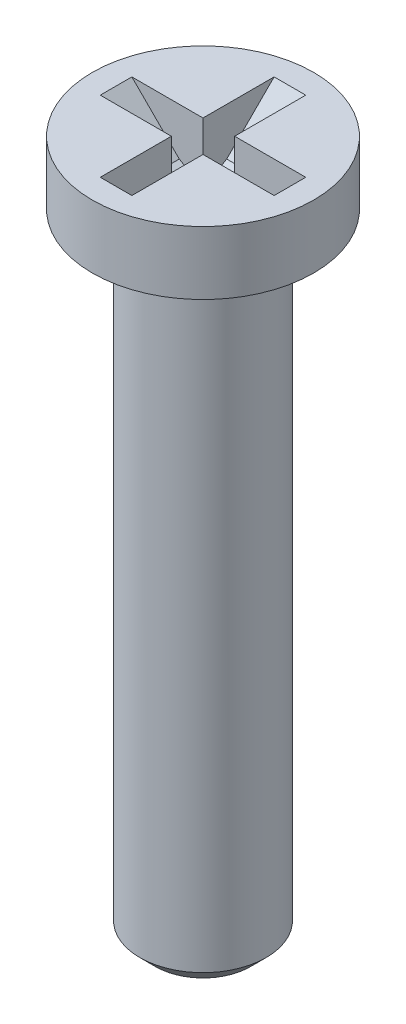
ISO-10303-21;
HEADER;
FILE_DESCRIPTION(('STEP AP214'),'2;1');
FILE_NAME('part.step','',(''),(''),'','','');
FILE_SCHEMA(('AUTOMOTIVE_DESIGN { 1 0 10303 214 1 1 1 1 }'));
ENDSEC;
DATA;
#1=APPLICATION_CONTEXT('core data for automotive mechanical design processes');
#2=APPLICATION_PROTOCOL_DEFINITION('international standard','automotive_design',2000,#1);
#3=PRODUCT_CONTEXT('',#1,'mechanical');
#4=PRODUCT('Part','Part','',(#3));
#5=PRODUCT_RELATED_PRODUCT_CATEGORY('part','',(#4));
#6=PRODUCT_DEFINITION_FORMATION('','',#4);
#7=PRODUCT_DEFINITION_CONTEXT('part definition',#1,'design');
#8=PRODUCT_DEFINITION('design','',#6,#7);
#9=PRODUCT_DEFINITION_SHAPE('','',#8);
#10=(LENGTH_UNIT() NAMED_UNIT(*) SI_UNIT(.MILLI.,.METRE.));
#11=(NAMED_UNIT(*) PLANE_ANGLE_UNIT() SI_UNIT($,.RADIAN.));
#12=(NAMED_UNIT(*) SI_UNIT($,.STERADIAN.) SOLID_ANGLE_UNIT());
#13=UNCERTAINTY_MEASURE_WITH_UNIT(LENGTH_MEASURE(1.E-05),#10,'distance_accuracy_value','');
#14=(GEOMETRIC_REPRESENTATION_CONTEXT(3) GLOBAL_UNCERTAINTY_ASSIGNED_CONTEXT((#13)) GLOBAL_UNIT_ASSIGNED_CONTEXT((#10,
#11,#12)) REPRESENTATION_CONTEXT('',''));
#15=CARTESIAN_POINT('',(0.,0.,0.));
#16=DIRECTION('',(0.,0.,1.));
#17=DIRECTION('',(1.,0.,0.));
#18=AXIS2_PLACEMENT_3D('',#15,#16,#17);
#19=CARTESIAN_POINT('',(-0.2,-0.5732050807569,-0.2));
#20=DIRECTION('',(0.,-1.,0.));
#21=DIRECTION('',(0.,0.,-1.));
#22=AXIS2_PLACEMENT_3D('',#19,#20,#21);
#23=PLANE('',#22);
#24=DIRECTION('',(1.,0.,0.));
#25=VECTOR('',#24,1.);
#26=CARTESIAN_POINT('',(0.2,-0.573205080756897,-0.199999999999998));
#27=LINE('',#26,#25);
#28=CARTESIAN_POINT('',(0.199999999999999,-0.573205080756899,-0.2));
#29=VERTEX_POINT('',#28);
#30=CARTESIAN_POINT('',(-0.2,-0.573205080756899,-0.199999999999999));
#31=VERTEX_POINT('',#30);
#32=EDGE_CURVE('E135',#29,#31,#27,.F.);
#33=ORIENTED_EDGE('',*,*,#32,.T.);
#34=DIRECTION('',(0.,0.,1.));
#35=VECTOR('',#34,1.);
#36=CARTESIAN_POINT('',(-0.199999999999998,-0.573205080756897,-0.2));
#37=LINE('',#36,#35);
#38=CARTESIAN_POINT('',(-0.2,-0.573205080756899,0.199999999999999));
#39=VERTEX_POINT('',#38);
#40=EDGE_CURVE('E116',#31,#39,#37,.T.);
#41=ORIENTED_EDGE('',*,*,#40,.T.);
#42=DIRECTION('',(1.,0.,0.));
#43=VECTOR('',#42,1.);
#44=CARTESIAN_POINT('',(-0.2,-0.573205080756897,0.199999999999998));
#45=LINE('',#44,#43);
#46=CARTESIAN_POINT('',(0.2,-0.573205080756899,0.199999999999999));
#47=VERTEX_POINT('',#46);
#48=EDGE_CURVE('E112',#39,#47,#45,.T.);
#49=ORIENTED_EDGE('',*,*,#48,.T.);
#50=DIRECTION('',(0.,0.,1.));
#51=VECTOR('',#50,1.);
#52=CARTESIAN_POINT('',(0.199999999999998,-0.573205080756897,0.2));
#53=LINE('',#52,#51);
#54=EDGE_CURVE('E137',#47,#29,#53,.F.);
#55=ORIENTED_EDGE('',*,*,#54,.T.);
#56=EDGE_LOOP('',(#33,#41,#49,#55));
#57=FACE_BOUND('',#56,.T.);
#58=ADVANCED_FACE('F17',(#57),#23,.F.);
#59=CARTESIAN_POINT('',(-0.2,-0.4,0.5));
#60=DIRECTION('',(0.,-0.866025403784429,0.500000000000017));
#61=DIRECTION('',(0.,-0.500000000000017,-0.866025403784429));
#62=AXIS2_PLACEMENT_3D('',#59,#60,#61);
#63=PLANE('',#62);
#64=DIRECTION('',(0.,-0.500000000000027,-0.866025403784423));
#65=VECTOR('',#64,1.);
#66=CARTESIAN_POINT('',(0.2,-0.4,0.5));
#67=LINE('',#66,#65);
#68=CARTESIAN_POINT('',(0.2,-0.4,0.500000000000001));
#69=VERTEX_POINT('',#68);
#70=EDGE_CURVE('E130',#69,#47,#67,.T.);
#71=ORIENTED_EDGE('',*,*,#70,.T.);
#72=ORIENTED_EDGE('',*,*,#48,.F.);
#73=DIRECTION('',(0.,-0.500000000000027,-0.866025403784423));
#74=VECTOR('',#73,1.);
#75=CARTESIAN_POINT('',(-0.2,-0.4,0.5));
#76=LINE('',#75,#74);
#77=CARTESIAN_POINT('',(-0.2,-0.399999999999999,0.500000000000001));
#78=VERTEX_POINT('',#77);
#79=EDGE_CURVE('E109',#78,#39,#76,.T.);
#80=ORIENTED_EDGE('',*,*,#79,.F.);
#81=DIRECTION('',(1.,0.,0.));
#82=VECTOR('',#81,1.);
#83=CARTESIAN_POINT('',(-0.2,-0.4,0.5));
#84=LINE('',#83,#82);
#85=EDGE_CURVE('E105',#78,#69,#84,.T.);
#86=ORIENTED_EDGE('',*,*,#85,.T.);
#87=EDGE_LOOP('',(#71,#72,#80,#86));
#88=FACE_BOUND('',#87,.T.);
#89=ADVANCED_FACE('F111',(#88),#63,.F.);
#90=CARTESIAN_POINT('',(0.5,-0.4,0.2));
#91=DIRECTION('',(0.500000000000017,-0.866025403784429,0.));
#92=DIRECTION('',(0.866025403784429,0.500000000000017,0.));
#93=AXIS2_PLACEMENT_3D('',#90,#91,#92);
#94=PLANE('',#93);
#95=DIRECTION('',(-0.866025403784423,-0.500000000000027,0.));
#96=VECTOR('',#95,1.);
#97=CARTESIAN_POINT('',(0.5,-0.4,-0.2));
#98=LINE('',#97,#96);
#99=CARTESIAN_POINT('',(0.500000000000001,-0.4,-0.2));
#100=VERTEX_POINT('',#99);
#101=EDGE_CURVE('E212',#100,#29,#98,.T.);
#102=ORIENTED_EDGE('',*,*,#101,.T.);
#103=ORIENTED_EDGE('',*,*,#54,.F.);
#104=DIRECTION('',(0.866025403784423,0.500000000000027,0.));
#105=VECTOR('',#104,1.);
#106=CARTESIAN_POINT('',(0.2,-0.5732050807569,0.2));
#107=LINE('',#106,#105);
#108=CARTESIAN_POINT('',(0.500000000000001,-0.4,0.2));
#109=VERTEX_POINT('',#108);
#110=EDGE_CURVE('E223',#47,#109,#107,.T.);
#111=ORIENTED_EDGE('',*,*,#110,.T.);
#112=DIRECTION('',(0.,0.,1.));
#113=VECTOR('',#112,1.);
#114=CARTESIAN_POINT('',(0.5,-0.4,0.2));
#115=LINE('',#114,#113);
#116=EDGE_CURVE('E218',#109,#100,#115,.F.);
#117=ORIENTED_EDGE('',*,*,#116,.T.);
#118=EDGE_LOOP('',(#102,#103,#111,#117));
#119=FACE_BOUND('',#118,.T.);
#120=ADVANCED_FACE('F236',(#119),#94,.F.);
#121=CARTESIAN_POINT('',(0.2,-0.4,-0.5));
#122=DIRECTION('',(0.,-0.866025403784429,-0.500000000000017));
#123=DIRECTION('',(0.,0.500000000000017,-0.866025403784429));
#124=AXIS2_PLACEMENT_3D('',#121,#122,#123);
#125=PLANE('',#124);
#126=DIRECTION('',(0.,-0.500000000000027,0.866025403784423));
#127=VECTOR('',#126,1.);
#128=CARTESIAN_POINT('',(-0.2,-0.4,-0.5));
#129=LINE('',#128,#127);
#130=CARTESIAN_POINT('',(-0.2,-0.4,-0.500000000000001));
#131=VERTEX_POINT('',#130);
#132=EDGE_CURVE('E195',#131,#31,#129,.T.);
#133=ORIENTED_EDGE('',*,*,#132,.T.);
#134=ORIENTED_EDGE('',*,*,#32,.F.);
#135=DIRECTION('',(0.,-0.500000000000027,0.866025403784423));
#136=VECTOR('',#135,1.);
#137=CARTESIAN_POINT('',(0.2,-0.4,-0.5));
#138=LINE('',#137,#136);
#139=CARTESIAN_POINT('',(0.2,-0.399999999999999,-0.500000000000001));
#140=VERTEX_POINT('',#139);
#141=EDGE_CURVE('E209',#140,#29,#138,.T.);
#142=ORIENTED_EDGE('',*,*,#141,.F.);
#143=DIRECTION('',(1.,0.,0.));
#144=VECTOR('',#143,1.);
#145=CARTESIAN_POINT('',(0.2,-0.4,-0.5));
#146=LINE('',#145,#144);
#147=EDGE_CURVE('E201',#140,#131,#146,.F.);
#148=ORIENTED_EDGE('',*,*,#147,.T.);
#149=EDGE_LOOP('',(#133,#134,#142,#148));
#150=FACE_BOUND('',#149,.T.);
#151=ADVANCED_FACE('F257',(#150),#125,.F.);
#152=CARTESIAN_POINT('',(-0.5,-0.4,-0.2));
#153=DIRECTION('',(-0.500000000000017,-0.866025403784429,0.));
#154=DIRECTION('',(0.866025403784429,-0.500000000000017,0.));
#155=AXIS2_PLACEMENT_3D('',#152,#153,#154);
#156=PLANE('',#155);
#157=DIRECTION('',(0.866025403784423,-0.500000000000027,0.));
#158=VECTOR('',#157,1.);
#159=CARTESIAN_POINT('',(-0.5,-0.4,-0.2));
#160=LINE('',#159,#158);
#161=CARTESIAN_POINT('',(-0.500000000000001,-0.399999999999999,-0.2));
#162=VERTEX_POINT('',#161);
#163=EDGE_CURVE('E192',#162,#31,#160,.T.);
#164=ORIENTED_EDGE('',*,*,#163,.F.);
#165=DIRECTION('',(0.,0.,1.));
#166=VECTOR('',#165,1.);
#167=CARTESIAN_POINT('',(-0.5,-0.4,-0.2));
#168=LINE('',#167,#166);
#169=CARTESIAN_POINT('',(-0.500000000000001,-0.4,0.2));
#170=VERTEX_POINT('',#169);
#171=EDGE_CURVE('E184',#162,#170,#168,.T.);
#172=ORIENTED_EDGE('',*,*,#171,.T.);
#173=DIRECTION('',(0.866025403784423,-0.500000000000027,0.));
#174=VECTOR('',#173,1.);
#175=CARTESIAN_POINT('',(-0.5,-0.4,0.2));
#176=LINE('',#175,#174);
#177=EDGE_CURVE('E178',#170,#39,#176,.T.);
#178=ORIENTED_EDGE('',*,*,#177,.T.);
#179=ORIENTED_EDGE('',*,*,#40,.F.);
#180=EDGE_LOOP('',(#164,#172,#178,#179));
#181=FACE_BOUND('',#180,.T.);
#182=ADVANCED_FACE('F262',(#181),#156,.F.);
#183=CARTESIAN_POINT('',(-0.2,0.,0.));
#184=DIRECTION('',(1.,0.,0.));
#185=DIRECTION('',(0.,0.,-1.));
#186=AXIS2_PLACEMENT_3D('',#183,#184,#185);
#187=PLANE('',#186);
#188=DIRECTION('',(0.,1.,0.));
#189=VECTOR('',#188,1.);
#190=CARTESIAN_POINT('',(-0.2,0.,0.2));
#191=LINE('',#190,#189);
#192=CARTESIAN_POINT('',(-0.2,0.2,0.2));
#193=VERTEX_POINT('',#192);
#194=EDGE_CURVE('E182',#39,#193,#191,.T.);
#195=ORIENTED_EDGE('',*,*,#194,.T.);
#196=DIRECTION('',(0.,0.,-1.));
#197=VECTOR('',#196,1.);
#198=CARTESIAN_POINT('',(-0.2,0.2,0.));
#199=LINE('',#198,#197);
#200=CARTESIAN_POINT('',(-0.2,0.2,1.1));
#201=VERTEX_POINT('',#200);
#202=EDGE_CURVE('E121',#193,#201,#199,.F.);
#203=ORIENTED_EDGE('',*,*,#202,.T.);
#204=DIRECTION('',(0.,-0.707106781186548,-0.707106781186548));
#205=VECTOR('',#204,1.);
#206=CARTESIAN_POINT('',(-0.2,0.,0.9));
#207=LINE('',#206,#205);
#208=EDGE_CURVE('E115',#201,#78,#207,.T.);
#209=ORIENTED_EDGE('',*,*,#208,.T.);
#210=ORIENTED_EDGE('',*,*,#79,.T.);
#211=EDGE_LOOP('',(#195,#203,#209,#210));
#212=FACE_BOUND('',#211,.T.);
#213=ADVANCED_FACE('F119',(#212),#187,.T.);
#214=CARTESIAN_POINT('',(-0.2,0.,0.9));
#215=DIRECTION('',(0.,-0.707106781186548,0.707106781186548));
#216=DIRECTION('',(0.,-0.707106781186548,-0.707106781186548));
#217=AXIS2_PLACEMENT_3D('',#214,#215,#216);
#218=PLANE('',#217);
#219=ORIENTED_EDGE('',*,*,#85,.F.);
#220=ORIENTED_EDGE('',*,*,#208,.F.);
#221=DIRECTION('',(1.,0.,0.));
#222=VECTOR('',#221,1.);
#223=CARTESIAN_POINT('',(0.,0.2,1.1));
#224=LINE('',#223,#222);
#225=CARTESIAN_POINT('',(0.2,0.2,1.1));
#226=VERTEX_POINT('',#225);
#227=EDGE_CURVE('E175',#201,#226,#224,.T.);
#228=ORIENTED_EDGE('',*,*,#227,.T.);
#229=DIRECTION('',(0.,-0.707106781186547,-0.707106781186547));
#230=VECTOR('',#229,1.);
#231=CARTESIAN_POINT('',(0.2,0.2,1.1));
#232=LINE('',#231,#230);
#233=EDGE_CURVE('E127',#226,#69,#232,.T.);
#234=ORIENTED_EDGE('',*,*,#233,.T.);
#235=EDGE_LOOP('',(#219,#220,#228,#234));
#236=FACE_BOUND('',#235,.T.);
#237=ADVANCED_FACE('F125',(#236),#218,.F.);
#238=CARTESIAN_POINT('',(0.2,0.,0.));
#239=DIRECTION('',(1.,0.,0.));
#240=DIRECTION('',(0.,0.,-1.));
#241=AXIS2_PLACEMENT_3D('',#238,#239,#240);
#242=PLANE('',#241);
#243=ORIENTED_EDGE('',*,*,#70,.F.);
#244=ORIENTED_EDGE('',*,*,#233,.F.);
#245=DIRECTION('',(0.,0.,-1.));
#246=VECTOR('',#245,1.);
#247=CARTESIAN_POINT('',(0.2,0.2,0.));
#248=LINE('',#247,#246);
#249=CARTESIAN_POINT('',(0.2,0.2,0.2));
#250=VERTEX_POINT('',#249);
#251=EDGE_CURVE('E173',#226,#250,#248,.T.);
#252=ORIENTED_EDGE('',*,*,#251,.T.);
#253=DIRECTION('',(0.,1.,0.));
#254=VECTOR('',#253,1.);
#255=CARTESIAN_POINT('',(0.2,0.,0.2));
#256=LINE('',#255,#254);
#257=EDGE_CURVE('E225',#250,#47,#256,.F.);
#258=ORIENTED_EDGE('',*,*,#257,.T.);
#259=EDGE_LOOP('',(#243,#244,#252,#258));
#260=FACE_BOUND('',#259,.T.);
#261=ADVANCED_FACE('F230',(#260),#242,.F.);
#262=CARTESIAN_POINT('',(0.,0.,0.2));
#263=DIRECTION('',(0.,0.,1.));
#264=DIRECTION('',(1.,0.,0.));
#265=AXIS2_PLACEMENT_3D('',#262,#263,#264);
#266=PLANE('',#265);
#267=DIRECTION('',(0.707106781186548,0.707106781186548,0.));
#268=VECTOR('',#267,1.);
#269=CARTESIAN_POINT('',(0.9,0.,0.2));
#270=LINE('',#269,#268);
#271=CARTESIAN_POINT('',(1.1,0.2,0.2));
#272=VERTEX_POINT('',#271);
#273=EDGE_CURVE('E220',#272,#109,#270,.F.);
#274=ORIENTED_EDGE('',*,*,#273,.T.);
#275=ORIENTED_EDGE('',*,*,#110,.F.);
#276=ORIENTED_EDGE('',*,*,#257,.F.);
#277=DIRECTION('',(1.,0.,0.));
#278=VECTOR('',#277,1.);
#279=CARTESIAN_POINT('',(0.,0.2,0.2));
#280=LINE('',#279,#278);
#281=EDGE_CURVE('E171',#250,#272,#280,.T.);
#282=ORIENTED_EDGE('',*,*,#281,.T.);
#283=EDGE_LOOP('',(#274,#275,#276,#282));
#284=FACE_BOUND('',#283,.T.);
#285=ADVANCED_FACE('F240',(#284),#266,.F.);
#286=CARTESIAN_POINT('',(0.9,0.,0.2));
#287=DIRECTION('',(0.707106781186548,-0.707106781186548,0.));
#288=DIRECTION('',(0.707106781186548,0.707106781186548,0.));
#289=AXIS2_PLACEMENT_3D('',#286,#287,#288);
#290=PLANE('',#289);
#291=ORIENTED_EDGE('',*,*,#116,.F.);
#292=ORIENTED_EDGE('',*,*,#273,.F.);
#293=DIRECTION('',(0.,0.,-1.));
#294=VECTOR('',#293,1.);
#295=CARTESIAN_POINT('',(1.1,0.2,0.));
#296=LINE('',#295,#294);
#297=CARTESIAN_POINT('',(1.1,0.2,-0.2));
#298=VERTEX_POINT('',#297);
#299=EDGE_CURVE('E169',#272,#298,#296,.T.);
#300=ORIENTED_EDGE('',*,*,#299,.T.);
#301=DIRECTION('',(-0.707106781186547,-0.707106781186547,0.));
#302=VECTOR('',#301,1.);
#303=CARTESIAN_POINT('',(1.1,0.2,-0.2));
#304=LINE('',#303,#302);
#305=EDGE_CURVE('E215',#298,#100,#304,.T.);
#306=ORIENTED_EDGE('',*,*,#305,.T.);
#307=EDGE_LOOP('',(#291,#292,#300,#306));
#308=FACE_BOUND('',#307,.T.);
#309=ADVANCED_FACE('F245',(#308),#290,.F.);
#310=CARTESIAN_POINT('',(0.,0.,-0.2));
#311=DIRECTION('',(0.,0.,-1.));
#312=DIRECTION('',(-1.,0.,0.));
#313=AXIS2_PLACEMENT_3D('',#310,#311,#312);
#314=PLANE('',#313);
#315=ORIENTED_EDGE('',*,*,#101,.F.);
#316=ORIENTED_EDGE('',*,*,#305,.F.);
#317=DIRECTION('',(1.,0.,0.));
#318=VECTOR('',#317,1.);
#319=CARTESIAN_POINT('',(0.,0.2,-0.2));
#320=LINE('',#319,#318);
#321=CARTESIAN_POINT('',(0.2,0.2,-0.2));
#322=VERTEX_POINT('',#321);
#323=EDGE_CURVE('E167',#298,#322,#320,.F.);
#324=ORIENTED_EDGE('',*,*,#323,.T.);
#325=DIRECTION('',(0.,1.,0.));
#326=VECTOR('',#325,1.);
#327=CARTESIAN_POINT('',(0.2,0.,-0.2));
#328=LINE('',#327,#326);
#329=EDGE_CURVE('E206',#29,#322,#328,.T.);
#330=ORIENTED_EDGE('',*,*,#329,.F.);
#331=EDGE_LOOP('',(#315,#316,#324,#330));
#332=FACE_BOUND('',#331,.T.);
#333=ADVANCED_FACE('F250',(#332),#314,.F.);
#334=CARTESIAN_POINT('',(0.2,0.,0.));
#335=DIRECTION('',(-1.,0.,0.));
#336=DIRECTION('',(0.,0.,1.));
#337=AXIS2_PLACEMENT_3D('',#334,#335,#336);
#338=PLANE('',#337);
#339=ORIENTED_EDGE('',*,*,#141,.T.);
#340=ORIENTED_EDGE('',*,*,#329,.T.);
#341=DIRECTION('',(0.,0.,-1.));
#342=VECTOR('',#341,1.);
#343=CARTESIAN_POINT('',(0.2,0.2,0.));
#344=LINE('',#343,#342);
#345=CARTESIAN_POINT('',(0.2,0.2,-1.1));
#346=VERTEX_POINT('',#345);
#347=EDGE_CURVE('E165',#322,#346,#344,.T.);
#348=ORIENTED_EDGE('',*,*,#347,.T.);
#349=DIRECTION('',(0.,0.707106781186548,-0.707106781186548));
#350=VECTOR('',#349,1.);
#351=CARTESIAN_POINT('',(0.2,0.,-0.9));
#352=LINE('',#351,#350);
#353=EDGE_CURVE('E203',#346,#140,#352,.F.);
#354=ORIENTED_EDGE('',*,*,#353,.T.);
#355=EDGE_LOOP('',(#339,#340,#348,#354));
#356=FACE_BOUND('',#355,.T.);
#357=ADVANCED_FACE('F253',(#356),#338,.T.);
#358=CARTESIAN_POINT('',(0.2,0.,-0.9));
#359=DIRECTION('',(0.,-0.707106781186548,-0.707106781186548));
#360=DIRECTION('',(0.,0.707106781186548,-0.707106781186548));
#361=AXIS2_PLACEMENT_3D('',#358,#359,#360);
#362=PLANE('',#361);
#363=ORIENTED_EDGE('',*,*,#147,.F.);
#364=ORIENTED_EDGE('',*,*,#353,.F.);
#365=DIRECTION('',(1.,0.,0.));
#366=VECTOR('',#365,1.);
#367=CARTESIAN_POINT('',(0.,0.2,-1.1));
#368=LINE('',#367,#366);
#369=CARTESIAN_POINT('',(-0.2,0.2,-1.1));
#370=VERTEX_POINT('',#369);
#371=EDGE_CURVE('E163',#346,#370,#368,.F.);
#372=ORIENTED_EDGE('',*,*,#371,.T.);
#373=DIRECTION('',(0.,-0.707106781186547,0.707106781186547));
#374=VECTOR('',#373,1.);
#375=CARTESIAN_POINT('',(-0.2,0.2,-1.1));
#376=LINE('',#375,#374);
#377=EDGE_CURVE('E198',#370,#131,#376,.T.);
#378=ORIENTED_EDGE('',*,*,#377,.T.);
#379=EDGE_LOOP('',(#363,#364,#372,#378));
#380=FACE_BOUND('',#379,.T.);
#381=ADVANCED_FACE('F371',(#380),#362,.F.);
#382=CARTESIAN_POINT('',(-0.2,0.,0.));
#383=DIRECTION('',(-1.,0.,0.));
#384=DIRECTION('',(0.,0.,1.));
#385=AXIS2_PLACEMENT_3D('',#382,#383,#384);
#386=PLANE('',#385);
#387=ORIENTED_EDGE('',*,*,#132,.F.);
#388=ORIENTED_EDGE('',*,*,#377,.F.);
#389=DIRECTION('',(0.,0.,-1.));
#390=VECTOR('',#389,1.);
#391=CARTESIAN_POINT('',(-0.2,0.2,0.));
#392=LINE('',#391,#390);
#393=CARTESIAN_POINT('',(-0.2,0.2,-0.2));
#394=VERTEX_POINT('',#393);
#395=EDGE_CURVE('E161',#370,#394,#392,.F.);
#396=ORIENTED_EDGE('',*,*,#395,.T.);
#397=DIRECTION('',(0.,1.,0.));
#398=VECTOR('',#397,1.);
#399=CARTESIAN_POINT('',(-0.2,0.,-0.2));
#400=LINE('',#399,#398);
#401=EDGE_CURVE('E189',#31,#394,#400,.T.);
#402=ORIENTED_EDGE('',*,*,#401,.F.);
#403=EDGE_LOOP('',(#387,#388,#396,#402));
#404=FACE_BOUND('',#403,.T.);
#405=ADVANCED_FACE('F265',(#404),#386,.F.);
#406=CARTESIAN_POINT('',(0.,0.,-0.2));
#407=DIRECTION('',(0.,0.,1.));
#408=DIRECTION('',(1.,0.,0.));
#409=AXIS2_PLACEMENT_3D('',#406,#407,#408);
#410=PLANE('',#409);
#411=ORIENTED_EDGE('',*,*,#163,.T.);
#412=ORIENTED_EDGE('',*,*,#401,.T.);
#413=DIRECTION('',(1.,0.,0.));
#414=VECTOR('',#413,1.);
#415=CARTESIAN_POINT('',(0.,0.2,-0.2));
#416=LINE('',#415,#414);
#417=CARTESIAN_POINT('',(-1.1,0.2,-0.2));
#418=VERTEX_POINT('',#417);
#419=EDGE_CURVE('E157',#394,#418,#416,.F.);
#420=ORIENTED_EDGE('',*,*,#419,.T.);
#421=DIRECTION('',(0.707106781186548,-0.707106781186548,0.));
#422=VECTOR('',#421,1.);
#423=CARTESIAN_POINT('',(-0.9,0.,-0.2));
#424=LINE('',#423,#422);
#425=EDGE_CURVE('E186',#418,#162,#424,.T.);
#426=ORIENTED_EDGE('',*,*,#425,.T.);
#427=EDGE_LOOP('',(#411,#412,#420,#426));
#428=FACE_BOUND('',#427,.T.);
#429=ADVANCED_FACE('F270',(#428),#410,.T.);
#430=CARTESIAN_POINT('',(-0.9,0.,-0.2));
#431=DIRECTION('',(-0.707106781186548,-0.707106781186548,0.));
#432=DIRECTION('',(0.707106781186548,-0.707106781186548,0.));
#433=AXIS2_PLACEMENT_3D('',#430,#431,#432);
#434=PLANE('',#433);
#435=ORIENTED_EDGE('',*,*,#171,.F.);
#436=ORIENTED_EDGE('',*,*,#425,.F.);
#437=DIRECTION('',(0.,0.,-1.));
#438=VECTOR('',#437,1.);
#439=CARTESIAN_POINT('',(-1.1,0.2,0.));
#440=LINE('',#439,#438);
#441=CARTESIAN_POINT('',(-1.1,0.2,0.2));
#442=VERTEX_POINT('',#441);
#443=EDGE_CURVE('E35',#418,#442,#440,.F.);
#444=ORIENTED_EDGE('',*,*,#443,.T.);
#445=DIRECTION('',(0.707106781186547,-0.707106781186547,0.));
#446=VECTOR('',#445,1.);
#447=CARTESIAN_POINT('',(-1.1,0.2,0.2));
#448=LINE('',#447,#446);
#449=EDGE_CURVE('E180',#442,#170,#448,.T.);
#450=ORIENTED_EDGE('',*,*,#449,.T.);
#451=EDGE_LOOP('',(#435,#436,#444,#450));
#452=FACE_BOUND('',#451,.T.);
#453=ADVANCED_FACE('F272',(#452),#434,.F.);
#454=CARTESIAN_POINT('',(0.,0.,0.2));
#455=DIRECTION('',(0.,0.,1.));
#456=DIRECTION('',(1.,0.,0.));
#457=AXIS2_PLACEMENT_3D('',#454,#455,#456);
#458=PLANE('',#457);
#459=ORIENTED_EDGE('',*,*,#449,.F.);
#460=DIRECTION('',(1.,0.,0.));
#461=VECTOR('',#460,1.);
#462=CARTESIAN_POINT('',(0.,0.2,0.2));
#463=LINE('',#462,#461);
#464=EDGE_CURVE('E149',#442,#193,#463,.T.);
#465=ORIENTED_EDGE('',*,*,#464,.T.);
#466=ORIENTED_EDGE('',*,*,#194,.F.);
#467=ORIENTED_EDGE('',*,*,#177,.F.);
#468=EDGE_LOOP('',(#459,#465,#466,#467));
#469=FACE_BOUND('',#468,.T.);
#470=ADVANCED_FACE('F273',(#469),#458,.F.);
#471=CARTESIAN_POINT('',(0.,0.2,0.));
#472=DIRECTION('',(0.,-1.,0.));
#473=DIRECTION('',(0.,0.,-1.));
#474=AXIS2_PLACEMENT_3D('',#471,#472,#473);
#475=PLANE('',#474);
#476=ORIENTED_EDGE('',*,*,#443,.F.);
#477=ORIENTED_EDGE('',*,*,#419,.F.);
#478=ORIENTED_EDGE('',*,*,#395,.F.);
#479=ORIENTED_EDGE('',*,*,#371,.F.);
#480=ORIENTED_EDGE('',*,*,#347,.F.);
#481=ORIENTED_EDGE('',*,*,#323,.F.);
#482=ORIENTED_EDGE('',*,*,#299,.F.);
#483=ORIENTED_EDGE('',*,*,#281,.F.);
#484=ORIENTED_EDGE('',*,*,#251,.F.);
#485=ORIENTED_EDGE('',*,*,#227,.F.);
#486=ORIENTED_EDGE('',*,*,#202,.F.);
#487=ORIENTED_EDGE('',*,*,#464,.F.);
#488=EDGE_LOOP('',(#476,#477,#478,#479,#480,#481,#482,#483,#484,#485,#486,#487));
#489=FACE_BOUND('',#488,.T.);
#490=CARTESIAN_POINT('',(0.,0.2,0.));
#491=DIRECTION('',(0.,-1.,0.));
#492=DIRECTION('',(0.,0.,-1.));
#493=AXIS2_PLACEMENT_3D('',#490,#491,#492);
#494=CIRCLE('',#493,1.4);
#495=CARTESIAN_POINT('',(0.,0.2,-1.4));
#496=VERTEX_POINT('',#495);
#497=EDGE_CURVE('E20',#496,#496,#494,.T.);
#498=ORIENTED_EDGE('',*,*,#497,.F.);
#499=EDGE_LOOP('',(#498));
#500=FACE_BOUND('',#499,.T.);
#501=ADVANCED_FACE('F275',(#489,#500),#475,.F.);
#502=CARTESIAN_POINT('',(0.,0.53,0.));
#503=DIRECTION('',(0.,-1.,0.));
#504=DIRECTION('',(0.,0.,-1.));
#505=AXIS2_PLACEMENT_3D('',#502,#503,#504);
#506=CYLINDRICAL_SURFACE('',#505,1.4);
#507=CARTESIAN_POINT('',(0.,-0.6,0.));
#508=DIRECTION('',(0.,-1.,0.));
#509=DIRECTION('',(0.,0.,-1.));
#510=AXIS2_PLACEMENT_3D('',#507,#508,#509);
#511=CIRCLE('',#510,1.4);
#512=CARTESIAN_POINT('',(0.,-0.6,-1.4));
#513=VERTEX_POINT('',#512);
#514=EDGE_CURVE('E144',#513,#513,#511,.T.);
#515=ORIENTED_EDGE('',*,*,#514,.F.);
#516=EDGE_LOOP('',(#515));
#517=FACE_BOUND('',#516,.T.);
#518=ORIENTED_EDGE('',*,*,#497,.T.);
#519=EDGE_LOOP('',(#518));
#520=FACE_BOUND('',#519,.T.);
#521=ADVANCED_FACE('F282',(#517,#520),#506,.T.);
#522=CARTESIAN_POINT('',(0.,-8.6,0.));
#523=DIRECTION('',(0.,-1.,0.));
#524=DIRECTION('',(0.,0.,-1.));
#525=AXIS2_PLACEMENT_3D('',#522,#523,#524);
#526=PLANE('',#525);
#527=CARTESIAN_POINT('',(0.,-8.60000000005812,0.));
#528=DIRECTION('',(0.,1.,0.));
#529=DIRECTION('',(0.,0.,1.));
#530=AXIS2_PLACEMENT_3D('',#527,#528,#529);
#531=CIRCLE('',#530,0.599999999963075);
#532=CARTESIAN_POINT('',(0.,-8.60000000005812,0.599999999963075));
#533=VERTEX_POINT('',#532);
#534=EDGE_CURVE('E142',#533,#533,#531,.T.);
#535=ORIENTED_EDGE('',*,*,#534,.F.);
#536=EDGE_LOOP('',(#535));
#537=FACE_BOUND('',#536,.T.);
#538=ADVANCED_FACE('F301',(#537),#526,.T.);
#539=CARTESIAN_POINT('',(0.,-0.6,0.));
#540=DIRECTION('',(0.,-1.,0.));
#541=DIRECTION('',(0.,0.,-1.));
#542=AXIS2_PLACEMENT_3D('',#539,#540,#541);
#543=PLANE('',#542);
#544=CARTESIAN_POINT('',(0.,-0.6,0.));
#545=DIRECTION('',(0.,-1.,0.));
#546=DIRECTION('',(0.,0.,-1.));
#547=AXIS2_PLACEMENT_3D('',#544,#545,#546);
#548=CIRCLE('',#547,0.8);
#549=CARTESIAN_POINT('',(0.,-0.6,-0.8));
#550=VERTEX_POINT('',#549);
#551=EDGE_CURVE('E26',#550,#550,#548,.T.);
#552=ORIENTED_EDGE('',*,*,#551,.F.);
#553=EDGE_LOOP('',(#552));
#554=FACE_BOUND('',#553,.T.);
#555=ORIENTED_EDGE('',*,*,#514,.T.);
#556=EDGE_LOOP('',(#555));
#557=FACE_BOUND('',#556,.T.);
#558=ADVANCED_FACE('F294',(#554,#557),#543,.T.);
#559=CARTESIAN_POINT('',(0.,-8.40000000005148,0.));
#560=DIRECTION('',(0.,1.,0.));
#561=DIRECTION('',(0.,0.,1.));
#562=AXIS2_PLACEMENT_3D('',#559,#560,#561);
#563=CONICAL_SURFACE('',#562,0.799999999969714,0.785398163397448);
#564=ORIENTED_EDGE('',*,*,#534,.T.);
#565=EDGE_LOOP('',(#564));
#566=FACE_BOUND('',#565,.T.);
#567=CARTESIAN_POINT('',(0.,-8.4,0.));
#568=DIRECTION('',(0.,-1.,0.));
#569=DIRECTION('',(0.,0.,-1.));
#570=AXIS2_PLACEMENT_3D('',#567,#568,#569);
#571=CIRCLE('',#570,0.8);
#572=CARTESIAN_POINT('',(0.,-8.4,-0.8));
#573=VERTEX_POINT('',#572);
#574=EDGE_CURVE('E11',#573,#573,#571,.F.);
#575=ORIENTED_EDGE('',*,*,#574,.F.);
#576=EDGE_LOOP('',(#575));
#577=FACE_BOUND('',#576,.T.);
#578=ADVANCED_FACE('F288',(#566,#577),#563,.T.);
#579=CARTESIAN_POINT('',(0.,0.53,0.));
#580=DIRECTION('',(0.,-1.,0.));
#581=DIRECTION('',(0.,0.,-1.));
#582=AXIS2_PLACEMENT_3D('',#579,#580,#581);
#583=CYLINDRICAL_SURFACE('',#582,0.8);
#584=ORIENTED_EDGE('',*,*,#551,.T.);
#585=EDGE_LOOP('',(#584));
#586=FACE_BOUND('',#585,.T.);
#587=ORIENTED_EDGE('',*,*,#574,.T.);
#588=EDGE_LOOP('',(#587));
#589=FACE_BOUND('',#588,.T.);
#590=ADVANCED_FACE('F286',(#586,#589),#583,.T.);
#591=CLOSED_SHELL('',(#58,#89,#120,#151,#182,#213,#237,#261,#285,#309,#333,#357,#381,#405,#429,
#453,#470,#501,#521,#538,#558,#578,#590));
#592=MANIFOLD_SOLID_BREP('B1',#591);
#593=ADVANCED_BREP_SHAPE_REPRESENTATION('',(#18,#592),#14);
#594=SHAPE_DEFINITION_REPRESENTATION(#9,#593);
ENDSEC;
END-ISO-10303-21;
